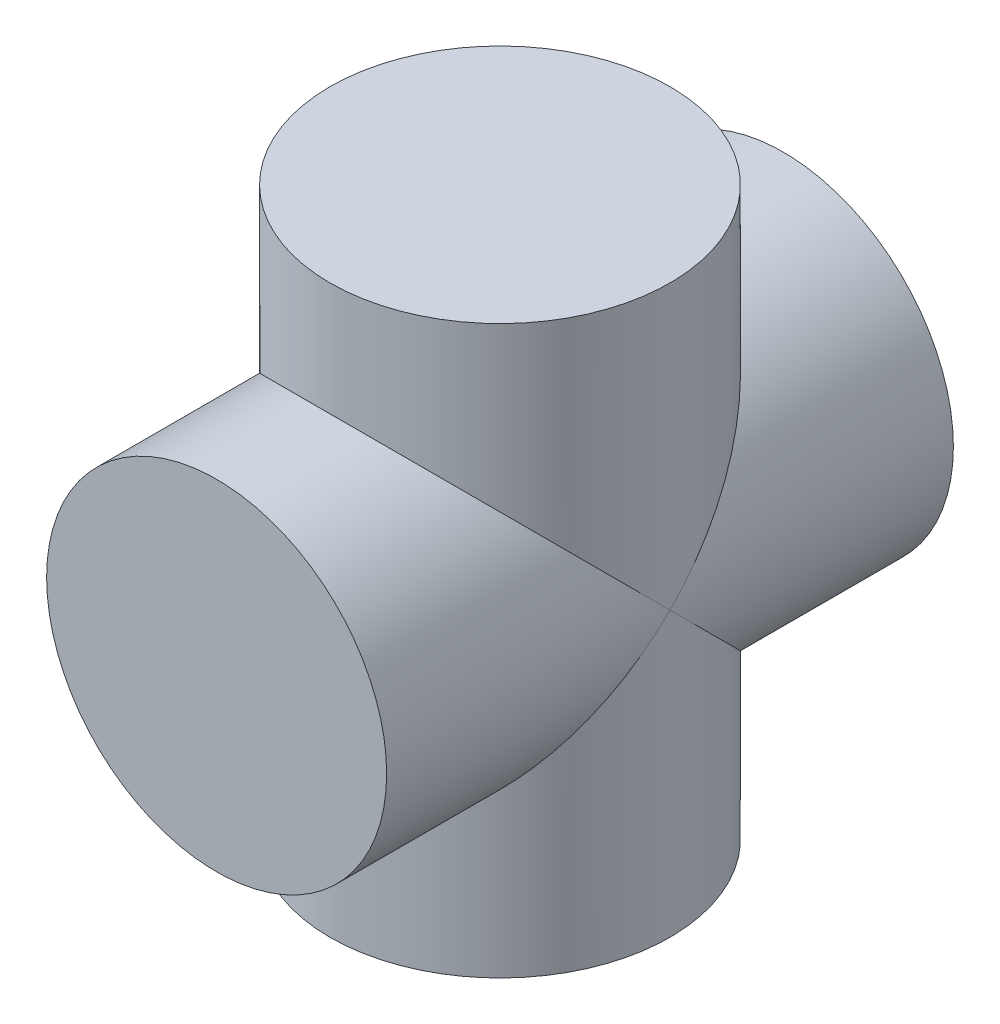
ISO-10303-21;
HEADER;
FILE_DESCRIPTION(('STEP AP214'),'2;1');
FILE_NAME('part.step','',(''),(''),'','','');
FILE_SCHEMA(('AUTOMOTIVE_DESIGN { 1 0 10303 214 1 1 1 1 }'));
ENDSEC;
DATA;
#1=APPLICATION_CONTEXT('core data for automotive mechanical design processes');
#2=APPLICATION_PROTOCOL_DEFINITION('international standard','automotive_design',2000,#1);
#3=PRODUCT_CONTEXT('',#1,'mechanical');
#4=PRODUCT('Part','Part','',(#3));
#5=PRODUCT_RELATED_PRODUCT_CATEGORY('part','',(#4));
#6=PRODUCT_DEFINITION_FORMATION('','',#4);
#7=PRODUCT_DEFINITION_CONTEXT('part definition',#1,'design');
#8=PRODUCT_DEFINITION('design','',#6,#7);
#9=PRODUCT_DEFINITION_SHAPE('','',#8);
#10=(LENGTH_UNIT() NAMED_UNIT(*) SI_UNIT(.MILLI.,.METRE.));
#11=(NAMED_UNIT(*) PLANE_ANGLE_UNIT() SI_UNIT($,.RADIAN.));
#12=(NAMED_UNIT(*) SI_UNIT($,.STERADIAN.) SOLID_ANGLE_UNIT());
#13=UNCERTAINTY_MEASURE_WITH_UNIT(LENGTH_MEASURE(1.E-05),#10,'distance_accuracy_value','');
#14=(GEOMETRIC_REPRESENTATION_CONTEXT(3) GLOBAL_UNCERTAINTY_ASSIGNED_CONTEXT((#13)) GLOBAL_UNIT_ASSIGNED_CONTEXT((#10,
#11,#12)) REPRESENTATION_CONTEXT('',''));
#15=CARTESIAN_POINT('',(0.,0.,0.));
#16=DIRECTION('',(0.,0.,1.));
#17=DIRECTION('',(1.,0.,0.));
#18=AXIS2_PLACEMENT_3D('',#15,#16,#17);
#19=CARTESIAN_POINT('',(0.,20.,0.));
#20=DIRECTION('',(0.,-1.,0.));
#21=DIRECTION('',(0.,0.,-1.));
#22=AXIS2_PLACEMENT_3D('',#19,#20,#21);
#23=CYLINDRICAL_SURFACE('',#22,6.);
#24=CARTESIAN_POINT('',(0.,20.,0.));
#25=DIRECTION('',(0.,1.,0.));
#26=DIRECTION('',(0.,0.,1.));
#27=AXIS2_PLACEMENT_3D('',#24,#25,#26);
#28=CIRCLE('',#27,6.);
#29=CARTESIAN_POINT('',(0.,20.,6.));
#30=VERTEX_POINT('',#29);
#31=EDGE_CURVE('E55',#30,#30,#28,.T.);
#32=ORIENTED_EDGE('',*,*,#31,.F.);
#33=EDGE_LOOP('',(#32));
#34=FACE_BOUND('',#33,.T.);
#35=CARTESIAN_POINT('',(0.,10.,0.));
#36=DIRECTION('',(0.,-0.707106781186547,-0.707106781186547));
#37=DIRECTION('',(0.,-0.707106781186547,0.707106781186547));
#38=AXIS2_PLACEMENT_3D('',#35,#36,#37);
#39=ELLIPSE('',#38,8.48528137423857,6.);
#40=CARTESIAN_POINT('',(-6.,10.,0.));
#41=VERTEX_POINT('',#40);
#42=CARTESIAN_POINT('',(6.,10.,0.));
#43=VERTEX_POINT('',#42);
#44=EDGE_CURVE('E39',#41,#43,#39,.T.);
#45=ORIENTED_EDGE('',*,*,#44,.F.);
#46=CARTESIAN_POINT('',(0.,10.,0.));
#47=DIRECTION('',(0.,-0.707106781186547,0.707106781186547));
#48=DIRECTION('',(0.,-0.707106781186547,-0.707106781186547));
#49=AXIS2_PLACEMENT_3D('',#46,#47,#48);
#50=ELLIPSE('',#49,8.48528137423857,6.);
#51=EDGE_CURVE('E51',#43,#41,#50,.T.);
#52=ORIENTED_EDGE('',*,*,#51,.F.);
#53=EDGE_LOOP('',(#45,#52));
#54=FACE_BOUND('',#53,.T.);
#55=ADVANCED_FACE('F31',(#34,#54),#23,.T.);
#56=CARTESIAN_POINT('',(0.,20.,0.));
#57=DIRECTION('',(0.,1.,0.));
#58=DIRECTION('',(0.,0.,1.));
#59=AXIS2_PLACEMENT_3D('',#56,#57,#58);
#60=PLANE('',#59);
#61=ORIENTED_EDGE('',*,*,#31,.T.);
#62=EDGE_LOOP('',(#61));
#63=FACE_BOUND('',#62,.T.);
#64=ADVANCED_FACE('F78',(#63),#60,.T.);
#65=CARTESIAN_POINT('',(0.,10.,-10.));
#66=DIRECTION('',(0.,0.,1.));
#67=DIRECTION('',(1.,0.,0.));
#68=AXIS2_PLACEMENT_3D('',#65,#66,#67);
#69=PLANE('',#68);
#70=CARTESIAN_POINT('',(0.,10.,-10.));
#71=DIRECTION('',(0.,0.,1.));
#72=DIRECTION('',(1.,0.,0.));
#73=AXIS2_PLACEMENT_3D('',#70,#71,#72);
#74=CIRCLE('',#73,6.);
#75=CARTESIAN_POINT('',(6.,10.,-10.));
#76=VERTEX_POINT('',#75);
#77=EDGE_CURVE('E92',#76,#76,#74,.T.);
#78=ORIENTED_EDGE('',*,*,#77,.F.);
#79=EDGE_LOOP('',(#78));
#80=FACE_BOUND('',#79,.T.);
#81=ADVANCED_FACE('F75',(#80),#69,.F.);
#82=CARTESIAN_POINT('',(0.,10.,10.));
#83=DIRECTION('',(0.,0.,-1.));
#84=DIRECTION('',(-1.,0.,0.));
#85=AXIS2_PLACEMENT_3D('',#82,#83,#84);
#86=CYLINDRICAL_SURFACE('',#85,6.);
#87=ORIENTED_EDGE('',*,*,#77,.T.);
#88=EDGE_LOOP('',(#87));
#89=FACE_BOUND('',#88,.T.);
#90=CARTESIAN_POINT('',(0.,10.,0.));
#91=DIRECTION('',(0.,-0.707106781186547,0.707106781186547));
#92=DIRECTION('',(0.,-0.707106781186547,-0.707106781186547));
#93=AXIS2_PLACEMENT_3D('',#90,#91,#92);
#94=ELLIPSE('',#93,8.48528137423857,6.);
#95=EDGE_CURVE('E45',#43,#41,#94,.F.);
#96=ORIENTED_EDGE('',*,*,#95,.T.);
#97=ORIENTED_EDGE('',*,*,#44,.T.);
#98=EDGE_LOOP('',(#96,#97));
#99=FACE_BOUND('',#98,.T.);
#100=ADVANCED_FACE('F57',(#89,#99),#86,.T.);
#101=CARTESIAN_POINT('',(0.,0.,0.));
#102=DIRECTION('',(0.,1.,0.));
#103=DIRECTION('',(0.,0.,1.));
#104=AXIS2_PLACEMENT_3D('',#101,#102,#103);
#105=PLANE('',#104);
#106=CARTESIAN_POINT('',(0.,0.,0.));
#107=DIRECTION('',(0.,1.,0.));
#108=DIRECTION('',(0.,0.,1.));
#109=AXIS2_PLACEMENT_3D('',#106,#107,#108);
#110=CIRCLE('',#109,6.);
#111=CARTESIAN_POINT('',(0.,0.,6.));
#112=VERTEX_POINT('',#111);
#113=EDGE_CURVE('E86',#112,#112,#110,.T.);
#114=ORIENTED_EDGE('',*,*,#113,.F.);
#115=EDGE_LOOP('',(#114));
#116=FACE_BOUND('',#115,.T.);
#117=ADVANCED_FACE('F69',(#116),#105,.F.);
#118=ORIENTED_EDGE('',*,*,#113,.T.);
#119=EDGE_LOOP('',(#118));
#120=FACE_BOUND('',#119,.T.);
#121=CARTESIAN_POINT('',(0.,10.,0.));
#122=DIRECTION('',(0.,-0.707106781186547,-0.707106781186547));
#123=DIRECTION('',(0.,-0.707106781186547,0.707106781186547));
#124=AXIS2_PLACEMENT_3D('',#121,#122,#123);
#125=ELLIPSE('',#124,8.48528137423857,6.);
#126=EDGE_CURVE('E11',#41,#43,#125,.F.);
#127=ORIENTED_EDGE('',*,*,#126,.F.);
#128=ORIENTED_EDGE('',*,*,#95,.F.);
#129=EDGE_LOOP('',(#127,#128));
#130=FACE_BOUND('',#129,.T.);
#131=ADVANCED_FACE('F33',(#120,#130),#23,.T.);
#132=CARTESIAN_POINT('',(0.,10.,10.));
#133=DIRECTION('',(0.,0.,1.));
#134=DIRECTION('',(1.,0.,0.));
#135=AXIS2_PLACEMENT_3D('',#132,#133,#134);
#136=CIRCLE('',#135,6.);
#137=CARTESIAN_POINT('',(6.,10.,10.));
#138=VERTEX_POINT('',#137);
#139=EDGE_CURVE('E89',#138,#138,#136,.T.);
#140=ORIENTED_EDGE('',*,*,#139,.F.);
#141=EDGE_LOOP('',(#140));
#142=FACE_BOUND('',#141,.T.);
#143=ORIENTED_EDGE('',*,*,#51,.T.);
#144=ORIENTED_EDGE('',*,*,#126,.T.);
#145=EDGE_LOOP('',(#143,#144));
#146=FACE_BOUND('',#145,.T.);
#147=ADVANCED_FACE('F58',(#142,#146),#86,.T.);
#148=CARTESIAN_POINT('',(0.,10.,10.));
#149=DIRECTION('',(0.,0.,1.));
#150=DIRECTION('',(1.,0.,0.));
#151=AXIS2_PLACEMENT_3D('',#148,#149,#150);
#152=PLANE('',#151);
#153=ORIENTED_EDGE('',*,*,#139,.T.);
#154=EDGE_LOOP('',(#153));
#155=FACE_BOUND('',#154,.T.);
#156=ADVANCED_FACE('F60',(#155),#152,.T.);
#157=CLOSED_SHELL('',(#55,#64,#81,#100,#117,#131,#147,#156));
#158=MANIFOLD_SOLID_BREP('B2',#157);
#159=ADVANCED_BREP_SHAPE_REPRESENTATION('',(#18,#158),#14);
#160=SHAPE_DEFINITION_REPRESENTATION(#9,#159);
ENDSEC;
END-ISO-10303-21;
